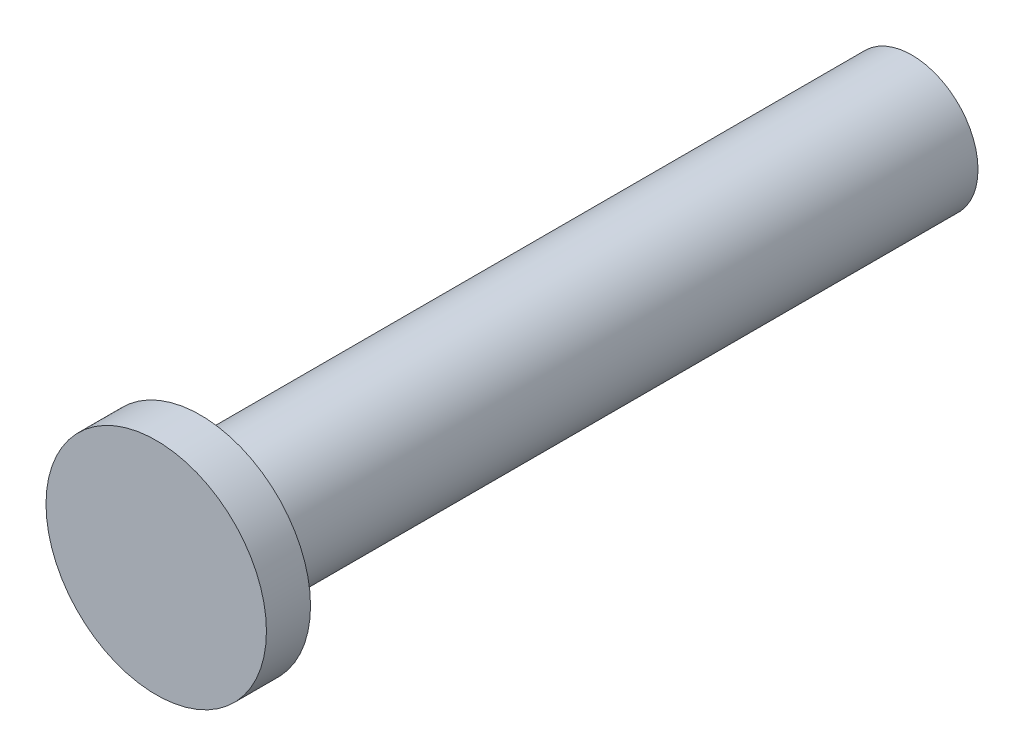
ISO-10303-21;
HEADER;
FILE_DESCRIPTION(('STEP AP214'),'2;1');
FILE_NAME('part.step','',(''),(''),'','','');
FILE_SCHEMA(('AUTOMOTIVE_DESIGN { 1 0 10303 214 1 1 1 1 }'));
ENDSEC;
DATA;
#1=APPLICATION_CONTEXT('core data for automotive mechanical design processes');
#2=APPLICATION_PROTOCOL_DEFINITION('international standard','automotive_design',2000,#1);
#3=PRODUCT_CONTEXT('',#1,'mechanical');
#4=PRODUCT('Part','Part','',(#3));
#5=PRODUCT_RELATED_PRODUCT_CATEGORY('part','',(#4));
#6=PRODUCT_DEFINITION_FORMATION('','',#4);
#7=PRODUCT_DEFINITION_CONTEXT('part definition',#1,'design');
#8=PRODUCT_DEFINITION('design','',#6,#7);
#9=PRODUCT_DEFINITION_SHAPE('','',#8);
#10=(LENGTH_UNIT() NAMED_UNIT(*) SI_UNIT(.MILLI.,.METRE.));
#11=(NAMED_UNIT(*) PLANE_ANGLE_UNIT() SI_UNIT($,.RADIAN.));
#12=(NAMED_UNIT(*) SI_UNIT($,.STERADIAN.) SOLID_ANGLE_UNIT());
#13=UNCERTAINTY_MEASURE_WITH_UNIT(LENGTH_MEASURE(1.E-05),#10,'distance_accuracy_value','');
#14=(GEOMETRIC_REPRESENTATION_CONTEXT(3) GLOBAL_UNCERTAINTY_ASSIGNED_CONTEXT((#13)) GLOBAL_UNIT_ASSIGNED_CONTEXT((#10,
#11,#12)) REPRESENTATION_CONTEXT('',''));
#15=CARTESIAN_POINT('',(0.,0.,0.));
#16=DIRECTION('',(0.,0.,1.));
#17=DIRECTION('',(1.,0.,0.));
#18=AXIS2_PLACEMENT_3D('',#15,#16,#17);
#19=CARTESIAN_POINT('',(0.,0.,16.14));
#20=DIRECTION('',(0.,0.,-1.));
#21=DIRECTION('',(-1.,0.,0.));
#22=AXIS2_PLACEMENT_3D('',#19,#20,#21);
#23=CYLINDRICAL_SURFACE('',#22,1.5);
#24=CARTESIAN_POINT('',(0.,0.,16.14));
#25=DIRECTION('',(0.,0.,1.));
#26=DIRECTION('',(1.,0.,0.));
#27=AXIS2_PLACEMENT_3D('',#24,#25,#26);
#28=CIRCLE('',#27,1.5);
#29=CARTESIAN_POINT('',(1.50000000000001,0.,16.14));
#30=VERTEX_POINT('',#29);
#31=EDGE_CURVE('E10',#30,#30,#28,.T.);
#32=ORIENTED_EDGE('',*,*,#31,.F.);
#33=EDGE_LOOP('',(#32));
#34=FACE_BOUND('',#33,.T.);
#35=CARTESIAN_POINT('',(0.,0.,0.));
#36=DIRECTION('',(0.,0.,1.));
#37=DIRECTION('',(1.,0.,0.));
#38=AXIS2_PLACEMENT_3D('',#35,#36,#37);
#39=CIRCLE('',#38,1.5);
#40=CARTESIAN_POINT('',(1.5,0.,0.));
#41=VERTEX_POINT('',#40);
#42=EDGE_CURVE('E352',#41,#41,#39,.T.);
#43=ORIENTED_EDGE('',*,*,#42,.T.);
#44=EDGE_LOOP('',(#43));
#45=FACE_BOUND('',#44,.T.);
#46=ADVANCED_FACE('F346',(#34,#45),#23,.T.);
#47=CARTESIAN_POINT('',(0.,0.,0.));
#48=DIRECTION('',(0.,0.,1.));
#49=DIRECTION('',(1.,0.,0.));
#50=AXIS2_PLACEMENT_3D('',#47,#48,#49);
#51=PLANE('',#50);
#52=ORIENTED_EDGE('',*,*,#42,.F.);
#53=EDGE_LOOP('',(#52));
#54=FACE_BOUND('',#53,.T.);
#55=ADVANCED_FACE('F370',(#54),#51,.F.);
#56=CARTESIAN_POINT('',(0.,0.,16.14));
#57=DIRECTION('',(0.,0.,1.));
#58=DIRECTION('',(1.,0.,0.));
#59=AXIS2_PLACEMENT_3D('',#56,#57,#58);
#60=PLANE('',#59);
#61=CARTESIAN_POINT('',(0.,0.,16.14));
#62=DIRECTION('',(0.,0.,1.));
#63=DIRECTION('',(1.,0.,0.));
#64=AXIS2_PLACEMENT_3D('',#61,#62,#63);
#65=CIRCLE('',#64,2.5);
#66=CARTESIAN_POINT('',(2.50000000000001,0.,16.14));
#67=VERTEX_POINT('',#66);
#68=EDGE_CURVE('E360',#67,#67,#65,.T.);
#69=ORIENTED_EDGE('',*,*,#68,.F.);
#70=EDGE_LOOP('',(#69));
#71=FACE_BOUND('',#70,.T.);
#72=ORIENTED_EDGE('',*,*,#31,.T.);
#73=EDGE_LOOP('',(#72));
#74=FACE_BOUND('',#73,.T.);
#75=ADVANCED_FACE('F368',(#71,#74),#60,.F.);
#76=CARTESIAN_POINT('',(0.,0.,17.14));
#77=DIRECTION('',(0.,0.,-1.));
#78=DIRECTION('',(-1.,0.,0.));
#79=AXIS2_PLACEMENT_3D('',#76,#77,#78);
#80=CYLINDRICAL_SURFACE('',#79,2.5);
#81=CARTESIAN_POINT('',(0.,0.,17.14));
#82=DIRECTION('',(0.,0.,1.));
#83=DIRECTION('',(1.,0.,0.));
#84=AXIS2_PLACEMENT_3D('',#81,#82,#83);
#85=CIRCLE('',#84,2.5);
#86=CARTESIAN_POINT('',(2.5,0.,17.14));
#87=VERTEX_POINT('',#86);
#88=EDGE_CURVE('E356',#87,#87,#85,.T.);
#89=ORIENTED_EDGE('',*,*,#88,.F.);
#90=EDGE_LOOP('',(#89));
#91=FACE_BOUND('',#90,.T.);
#92=ORIENTED_EDGE('',*,*,#68,.T.);
#93=EDGE_LOOP('',(#92));
#94=FACE_BOUND('',#93,.T.);
#95=ADVANCED_FACE('F366',(#91,#94),#80,.T.);
#96=CARTESIAN_POINT('',(0.,0.,17.14));
#97=DIRECTION('',(0.,0.,1.));
#98=DIRECTION('',(1.,0.,0.));
#99=AXIS2_PLACEMENT_3D('',#96,#97,#98);
#100=PLANE('',#99);
#101=ORIENTED_EDGE('',*,*,#88,.T.);
#102=EDGE_LOOP('',(#101));
#103=FACE_BOUND('',#102,.T.);
#104=ADVANCED_FACE('F376',(#103),#100,.T.);
#105=CLOSED_SHELL('',(#46,#55,#75,#95,#104));
#106=MANIFOLD_SOLID_BREP('B2',#105);
#107=ADVANCED_BREP_SHAPE_REPRESENTATION('',(#18,#106),#14);
#108=SHAPE_DEFINITION_REPRESENTATION(#9,#107);
ENDSEC;
END-ISO-10303-21;
